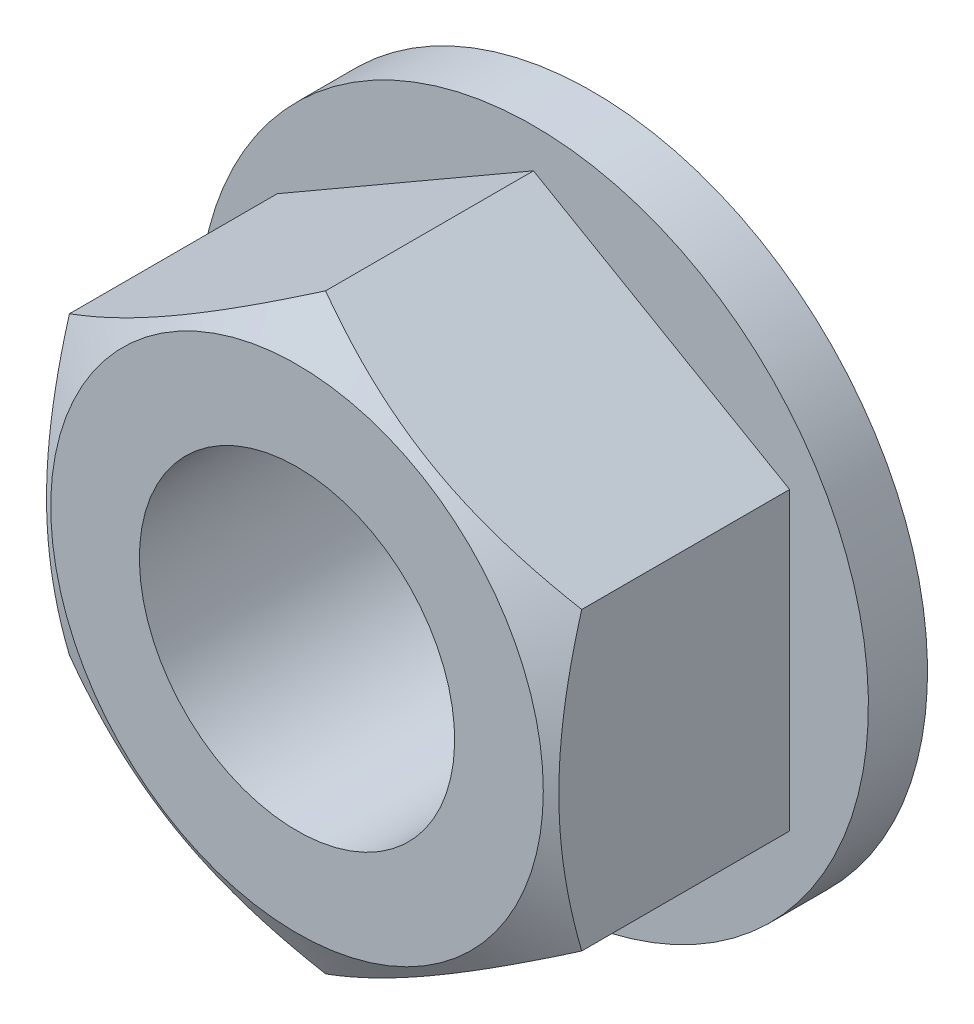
ISO-10303-21;
HEADER;
FILE_DESCRIPTION(('STEP AP214'),'2;1');
FILE_NAME('part.step','',(''),(''),'','','');
FILE_SCHEMA(('AUTOMOTIVE_DESIGN { 1 0 10303 214 1 1 1 1 }'));
ENDSEC;
DATA;
#1=APPLICATION_CONTEXT('core data for automotive mechanical design processes');
#2=APPLICATION_PROTOCOL_DEFINITION('international standard','automotive_design',2000,#1);
#3=PRODUCT_CONTEXT('',#1,'mechanical');
#4=PRODUCT('Part','Part','',(#3));
#5=PRODUCT_RELATED_PRODUCT_CATEGORY('part','',(#4));
#6=PRODUCT_DEFINITION_FORMATION('','',#4);
#7=PRODUCT_DEFINITION_CONTEXT('part definition',#1,'design');
#8=PRODUCT_DEFINITION('design','',#6,#7);
#9=PRODUCT_DEFINITION_SHAPE('','',#8);
#10=(LENGTH_UNIT() NAMED_UNIT(*) SI_UNIT(.MILLI.,.METRE.));
#11=(NAMED_UNIT(*) PLANE_ANGLE_UNIT() SI_UNIT($,.RADIAN.));
#12=(NAMED_UNIT(*) SI_UNIT($,.STERADIAN.) SOLID_ANGLE_UNIT());
#13=UNCERTAINTY_MEASURE_WITH_UNIT(LENGTH_MEASURE(1.E-05),#10,'distance_accuracy_value','');
#14=(GEOMETRIC_REPRESENTATION_CONTEXT(3) GLOBAL_UNCERTAINTY_ASSIGNED_CONTEXT((#13)) GLOBAL_UNIT_ASSIGNED_CONTEXT((#10,
#11,#12)) REPRESENTATION_CONTEXT('',''));
#15=CARTESIAN_POINT('',(0.,0.,0.));
#16=DIRECTION('',(0.,0.,1.));
#17=DIRECTION('',(1.,0.,0.));
#18=AXIS2_PLACEMENT_3D('',#15,#16,#17);
#19=CARTESIAN_POINT('',(6.,-3.46410161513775,7.5));
#20=DIRECTION('',(0.,0.,1.));
#21=DIRECTION('',(0.866025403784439,-0.5,0.));
#22=AXIS2_PLACEMENT_3D('',#19,#20,#21);
#23=PLANE('',#22);
#24=CARTESIAN_POINT('',(0.,0.,7.5));
#25=DIRECTION('',(0.,0.,1.));
#26=DIRECTION('',(0.866025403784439,-0.5,0.));
#27=AXIS2_PLACEMENT_3D('',#24,#25,#26);
#28=CIRCLE('',#27,4.);
#29=CARTESIAN_POINT('',(3.46410161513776,-2.,7.5));
#30=VERTEX_POINT('',#29);
#31=EDGE_CURVE('E28',#30,#30,#28,.T.);
#32=ORIENTED_EDGE('',*,*,#31,.F.);
#33=EDGE_LOOP('',(#32));
#34=FACE_BOUND('',#33,.T.);
#35=CARTESIAN_POINT('',(0.,0.,7.5));
#36=DIRECTION('',(0.,0.,1.));
#37=DIRECTION('',(1.,0.,0.));
#38=AXIS2_PLACEMENT_3D('',#35,#36,#37);
#39=CIRCLE('',#38,6.25);
#40=CARTESIAN_POINT('',(6.25,0.,7.5));
#41=VERTEX_POINT('',#40);
#42=EDGE_CURVE('E83',#41,#41,#39,.T.);
#43=ORIENTED_EDGE('',*,*,#42,.T.);
#44=EDGE_LOOP('',(#43));
#45=FACE_BOUND('',#44,.T.);
#46=ADVANCED_FACE('F14',(#34,#45),#23,.T.);
#47=CARTESIAN_POINT('',(0.,7.50555349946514,-18.3578280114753));
#48=DIRECTION('',(-0.5,0.866025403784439,0.));
#49=DIRECTION('',(-0.866025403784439,-0.5,0.));
#50=AXIS2_PLACEMENT_3D('',#47,#48,#49);
#51=PLANE('',#50);
#52=DIRECTION('',(0.,0.,1.));
#53=VECTOR('',#52,1.);
#54=CARTESIAN_POINT('',(-6.5,3.75277674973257,-18.3578280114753));
#55=LINE('',#54,#53);
#56=CARTESIAN_POINT('',(-6.5,3.75277674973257,1.5));
#57=VERTEX_POINT('',#56);
#58=CARTESIAN_POINT('',(-6.5,3.75277674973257,6.77510584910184));
#59=VERTEX_POINT('',#58);
#60=EDGE_CURVE('E41',#57,#59,#55,.T.);
#61=ORIENTED_EDGE('',*,*,#60,.T.);
#62=CARTESIAN_POINT('',(-6.5002,3.75266127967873,6.77503918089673));
#63=CARTESIAN_POINT('',(-6.35732254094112,3.83515161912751,6.82265800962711));
#64=CARTESIAN_POINT('',(-6.21391236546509,3.91794952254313,6.86811573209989));
#65=CARTESIAN_POINT('',(-5.9259273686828,4.08421773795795,6.95411375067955));
#66=CARTESIAN_POINT('',(-5.78135207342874,4.16768832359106,6.99465192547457));
#67=CARTESIAN_POINT('',(-5.34531134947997,4.41943655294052,7.10809143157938));
#68=CARTESIAN_POINT('',(-5.05212471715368,4.5887079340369,7.17261462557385));
#69=CARTESIAN_POINT('',(-4.61337625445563,4.84201947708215,7.2482758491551));
#70=CARTESIAN_POINT('',(-4.46912536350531,4.92530276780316,7.26982957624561));
#71=CARTESIAN_POINT('',(-4.17997178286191,5.09224566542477,7.30597211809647));
#72=CARTESIAN_POINT('',(-4.03506915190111,5.17590523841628,7.32056154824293));
#73=CARTESIAN_POINT('',(-3.74501222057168,5.34336968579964,7.34240368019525));
#74=CARTESIAN_POINT('',(-3.59985839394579,5.427174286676,7.34966470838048));
#75=CARTESIAN_POINT('',(-3.30942466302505,5.59485627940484,7.35670213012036));
#76=CARTESIAN_POINT('',(-3.16414476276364,5.6787336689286,7.35647875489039));
#77=CARTESIAN_POINT('',(-2.76612405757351,5.90853103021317,7.34557897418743));
#78=CARTESIAN_POINT('',(-2.51351353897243,6.05437578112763,7.32728061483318));
#79=CARTESIAN_POINT('',(-2.00997032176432,6.34509659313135,7.26925609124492));
#80=CARTESIAN_POINT('',(-1.75903939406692,6.48997163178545,7.22951009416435));
#81=CARTESIAN_POINT('',(-1.25448277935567,6.78127752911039,7.13015652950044));
#82=CARTESIAN_POINT('',(-1.00092075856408,6.92767163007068,7.07012800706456));
#83=CARTESIAN_POINT('',(-0.497578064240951,7.21827667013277,6.93388744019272));
#84=CARTESIAN_POINT('',(-0.247790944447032,7.36249133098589,6.857707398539));
#85=CARTESIAN_POINT('',(0.000200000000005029,7.50566896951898,6.77503918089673));
#86=B_SPLINE_CURVE_WITH_KNOTS('',3,(#62,#63,#64,#65,#66,#67,#68,#69,#70,#71,#72,#73,#74,#75,#76,
#77,#78,#79,#80,#81,#82,#83,#84,#85),.UNSPECIFIED.,.F.,.F.,(4,2,2,2,2,2,2,2,2,2,2,4),(0.,
0.515105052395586,1.03043143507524,2.06322554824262,2.56697389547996,3.07067772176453,
3.57380860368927,4.07692394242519,4.9527935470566,5.82947446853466,6.72559912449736,
7.61996451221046),.UNSPECIFIED.);
#87=CARTESIAN_POINT('',(0.,7.50555349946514,6.77510584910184));
#88=VERTEX_POINT('',#87);
#89=EDGE_CURVE('E35',#59,#88,#86,.T.);
#90=ORIENTED_EDGE('',*,*,#89,.T.);
#91=DIRECTION('',(0.,0.,1.));
#92=VECTOR('',#91,1.);
#93=CARTESIAN_POINT('',(0.,7.50555349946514,-18.3578280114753));
#94=LINE('',#93,#92);
#95=CARTESIAN_POINT('',(0.,7.50555349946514,1.5));
#96=VERTEX_POINT('',#95);
#97=EDGE_CURVE('E224',#96,#88,#94,.T.);
#98=ORIENTED_EDGE('',*,*,#97,.F.);
#99=DIRECTION('',(-0.866025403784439,-0.5,0.));
#100=VECTOR('',#99,1.);
#101=CARTESIAN_POINT('',(0.,7.50555349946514,1.5));
#102=LINE('',#101,#100);
#103=EDGE_CURVE('E100',#96,#57,#102,.T.);
#104=ORIENTED_EDGE('',*,*,#103,.T.);
#105=EDGE_LOOP('',(#61,#90,#98,#104));
#106=FACE_BOUND('',#105,.T.);
#107=ADVANCED_FACE('F119',(#106),#51,.T.);
#108=CARTESIAN_POINT('',(6.5,3.75277674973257,-18.3578280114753));
#109=DIRECTION('',(0.5,0.866025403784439,0.));
#110=DIRECTION('',(0.,0.,1.));
#111=AXIS2_PLACEMENT_3D('',#108,#109,#110);
#112=PLANE('',#111);
#113=ORIENTED_EDGE('',*,*,#97,.T.);
#114=CARTESIAN_POINT('',(-0.000199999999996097,7.50566896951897,6.77503918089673));
#115=CARTESIAN_POINT('',(0.142677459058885,7.4231786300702,6.82265800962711));
#116=CARTESIAN_POINT('',(0.286087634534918,7.34038072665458,6.86811573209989));
#117=CARTESIAN_POINT('',(0.574072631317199,7.17411251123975,6.95411375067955));
#118=CARTESIAN_POINT('',(0.718647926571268,7.09064192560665,6.99465192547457));
#119=CARTESIAN_POINT('',(1.15468865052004,6.83889369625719,7.10809143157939));
#120=CARTESIAN_POINT('',(1.44787528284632,6.66962231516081,7.17261462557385));
#121=CARTESIAN_POINT('',(1.88662374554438,6.41631077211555,7.2482758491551));
#122=CARTESIAN_POINT('',(2.03087463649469,6.33302748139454,7.26982957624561));
#123=CARTESIAN_POINT('',(2.32002821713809,6.16608458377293,7.30597211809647));
#124=CARTESIAN_POINT('',(2.46493084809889,6.08242501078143,7.32056154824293));
#125=CARTESIAN_POINT('',(2.75498777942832,5.91496056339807,7.34240368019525));
#126=CARTESIAN_POINT('',(2.90014160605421,5.8311559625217,7.34966470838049));
#127=CARTESIAN_POINT('',(3.19057533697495,5.66347396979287,7.35670213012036));
#128=CARTESIAN_POINT('',(3.33585523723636,5.5795965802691,7.35647875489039));
#129=CARTESIAN_POINT('',(3.73387594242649,5.34979921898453,7.34557897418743));
#130=CARTESIAN_POINT('',(3.98648646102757,5.20395446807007,7.32728061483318));
#131=CARTESIAN_POINT('',(4.49002967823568,4.91323365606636,7.26925609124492));
#132=CARTESIAN_POINT('',(4.74096060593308,4.76835861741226,7.22951009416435));
#133=CARTESIAN_POINT('',(5.24551722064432,4.47705272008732,7.13015652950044));
#134=CARTESIAN_POINT('',(5.49907924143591,4.33065861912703,7.07012800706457));
#135=CARTESIAN_POINT('',(6.00242193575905,4.04005357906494,6.93388744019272));
#136=CARTESIAN_POINT('',(6.25220905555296,3.89583891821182,6.857707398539));
#137=CARTESIAN_POINT('',(6.5002,3.75266127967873,6.77503918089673));
#138=B_SPLINE_CURVE_WITH_KNOTS('',3,(#114,#115,#116,#117,#118,#119,#120,#121,#122,#123,#124,
#125,#126,#127,#128,#129,#130,#131,#132,#133,#134,#135,#136,#137),.UNSPECIFIED.,.F.,.F.,(4,2,2,
2,2,2,2,2,2,2,2,4),(0.,0.515105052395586,1.03043143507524,2.06322554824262,2.56697389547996,
3.07067772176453,3.57380860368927,4.07692394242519,4.95279354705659,5.82947446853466,
6.72559912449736,7.61996451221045),.UNSPECIFIED.);
#139=CARTESIAN_POINT('',(6.5,3.75277674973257,6.77510584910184));
#140=VERTEX_POINT('',#139);
#141=EDGE_CURVE('E153',#88,#140,#138,.T.);
#142=ORIENTED_EDGE('',*,*,#141,.T.);
#143=DIRECTION('',(0.,0.,1.));
#144=VECTOR('',#143,1.);
#145=CARTESIAN_POINT('',(6.5,3.75277674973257,-18.3578280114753));
#146=LINE('',#145,#144);
#147=CARTESIAN_POINT('',(6.5,3.75277674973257,1.5));
#148=VERTEX_POINT('',#147);
#149=EDGE_CURVE('E218',#148,#140,#146,.T.);
#150=ORIENTED_EDGE('',*,*,#149,.F.);
#151=DIRECTION('',(-0.866025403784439,0.5,0.));
#152=VECTOR('',#151,1.);
#153=CARTESIAN_POINT('',(6.5,3.75277674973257,1.5));
#154=LINE('',#153,#152);
#155=EDGE_CURVE('E99',#148,#96,#154,.T.);
#156=ORIENTED_EDGE('',*,*,#155,.T.);
#157=EDGE_LOOP('',(#113,#142,#150,#156));
#158=FACE_BOUND('',#157,.T.);
#159=ADVANCED_FACE('F165',(#158),#112,.T.);
#160=CARTESIAN_POINT('',(6.5,-3.75277674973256,-18.3578280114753));
#161=DIRECTION('',(1.,0.,0.));
#162=DIRECTION('',(0.,1.,0.));
#163=AXIS2_PLACEMENT_3D('',#160,#161,#162);
#164=PLANE('',#163);
#165=ORIENTED_EDGE('',*,*,#149,.T.);
#166=CARTESIAN_POINT('',(6.5,-10.0728796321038,4.1871458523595));
#167=CARTESIAN_POINT('',(6.5,-9.78904380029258,4.32480135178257));
#168=CARTESIAN_POINT('',(6.5,-9.50455558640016,4.46113476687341));
#169=CARTESIAN_POINT('',(6.5,-8.93392743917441,4.73041370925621));
#170=CARTESIAN_POINT('',(6.5,-8.6477872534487,4.86335870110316));
#171=CARTESIAN_POINT('',(6.5,-8.07203033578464,5.1257875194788));
#172=CARTESIAN_POINT('',(6.5,-7.78240315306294,5.25524849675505));
#173=CARTESIAN_POINT('',(6.5,-7.2008425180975,5.50886235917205));
#174=CARTESIAN_POINT('',(6.5,-6.90890917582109,5.63301549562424));
#175=CARTESIAN_POINT('',(6.5,-6.31288048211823,5.87847985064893));
#176=CARTESIAN_POINT('',(6.5,-6.00869485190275,5.99957305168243));
#177=CARTESIAN_POINT('',(6.5,-5.39676174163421,6.23257630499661));
#178=CARTESIAN_POINT('',(6.5,-5.08901386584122,6.34448532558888));
#179=CARTESIAN_POINT('',(6.5,-4.47004629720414,6.55617723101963));
#180=CARTESIAN_POINT('',(6.5,-4.15883510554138,6.6559847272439));
#181=CARTESIAN_POINT('',(6.5,-3.53194527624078,6.8402647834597));
#182=CARTESIAN_POINT('',(6.5,-3.21626808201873,6.9247421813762));
#183=CARTESIAN_POINT('',(6.5,-2.58203231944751,7.07385809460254));
#184=CARTESIAN_POINT('',(6.5,-2.26349936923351,7.13860382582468));
#185=CARTESIAN_POINT('',(6.5,-1.62243510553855,7.24457625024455));
#186=CARTESIAN_POINT('',(6.5,-1.29990417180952,7.28580515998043));
#187=CARTESIAN_POINT('',(6.5,-0.816536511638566,7.32727322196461));
#188=CARTESIAN_POINT('',(6.5,-0.656533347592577,7.33769678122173));
#189=CARTESIAN_POINT('',(6.5,-0.336222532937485,7.35177467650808));
#190=CARTESIAN_POINT('',(6.5,-0.175914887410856,7.3554291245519));
#191=CARTESIAN_POINT('',(6.5,0.144709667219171,7.35587411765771));
#192=CARTESIAN_POINT('',(6.5,0.305026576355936,7.35266463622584));
#193=CARTESIAN_POINT('',(6.5,0.625383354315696,7.33946206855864));
#194=CARTESIAN_POINT('',(6.5,0.785423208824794,7.32946864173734));
#195=CARTESIAN_POINT('',(6.5,1.17027275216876,7.2974909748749));
#196=CARTESIAN_POINT('',(6.5,1.39481951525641,7.27227523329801));
#197=CARTESIAN_POINT('',(6.5,1.84223103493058,7.20986555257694));
#198=CARTESIAN_POINT('',(6.5,2.06509555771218,7.17266997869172));
#199=CARTESIAN_POINT('',(6.5,2.7309193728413,7.04508704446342));
#200=CARTESIAN_POINT('',(6.5,3.17085766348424,6.93872709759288));
#201=CARTESIAN_POINT('',(6.5,3.82867749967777,6.75447989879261));
#202=CARTESIAN_POINT('',(6.5,4.04997582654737,6.68809168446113));
#203=CARTESIAN_POINT('',(6.5,4.49042271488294,6.54846732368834));
#204=CARTESIAN_POINT('',(6.5,4.70957126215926,6.47523113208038));
#205=CARTESIAN_POINT('',(6.5,5.1457884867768,6.32308195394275));
#206=CARTESIAN_POINT('',(6.5,5.36285783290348,6.24417086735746));
#207=CARTESIAN_POINT('',(6.5,5.79520115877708,6.08159565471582));
#208=CARTESIAN_POINT('',(6.5,6.01047515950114,5.99793158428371));
#209=CARTESIAN_POINT('',(6.5,6.51834251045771,5.79512807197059));
#210=CARTESIAN_POINT('',(6.5,6.81024471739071,5.6742610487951));
#211=CARTESIAN_POINT('',(6.5,7.3915705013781,5.42668947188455));
#212=CARTESIAN_POINT('',(6.5,7.68099392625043,5.29998456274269));
#213=CARTESIAN_POINT('',(6.5,8.25781819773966,5.04190984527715));
#214=CARTESIAN_POINT('',(6.5,8.54521862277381,4.91053909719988));
#215=CARTESIAN_POINT('',(6.5,9.11828767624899,4.64406650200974));
#216=CARTESIAN_POINT('',(6.5,9.40395626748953,4.50896457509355));
#217=CARTESIAN_POINT('',(6.5,9.97414428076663,4.23558683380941));
#218=CARTESIAN_POINT('',(6.5,10.258662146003,4.09730777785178));
#219=CARTESIAN_POINT('',(6.5,10.8264728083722,3.81825460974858));
#220=CARTESIAN_POINT('',(6.5,11.1097655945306,3.67748047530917));
#221=CARTESIAN_POINT('',(6.5,11.9580236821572,3.25211680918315));
#222=CARTESIAN_POINT('',(6.5,12.5214451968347,2.96444904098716));
#223=CARTESIAN_POINT('',(6.5,13.5981452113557,2.40772193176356));
#224=CARTESIAN_POINT('',(6.5,14.1116645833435,2.13912635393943));
#225=CARTESIAN_POINT('',(6.5,15.1367973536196,1.59828118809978));
#226=CARTESIAN_POINT('',(6.5,15.6484106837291,1.32603147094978));
#227=CARTESIAN_POINT('',(6.5,16.6688771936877,0.779431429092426));
#228=CARTESIAN_POINT('',(6.5,17.1777340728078,0.505087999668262));
#229=CARTESIAN_POINT('',(6.5,18.1942292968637,-0.0457814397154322));
#230=CARTESIAN_POINT('',(6.5,18.7018677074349,-0.322307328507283));
#231=CARTESIAN_POINT('',(6.5,19.2090577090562,-0.599647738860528));
#232=B_SPLINE_CURVE_WITH_KNOTS('',3,(#166,#167,#168,#169,#170,#171,#172,#173,#174,#175,#176,
#177,#178,#179,#180,#181,#182,#183,#184,#185,#186,#187,#188,#189,#190,#191,#192,#193,#194,#195,
#196,#197,#198,#199,#200,#201,#202,#203,#204,#205,#206,#207,#208,#209,#210,#211,#212,#213,#214,
#215,#216,#217,#218,#219,#220,#221,#222,#223,#224,#225,#226,#227,#228,#229,#230,#231),
.UNSPECIFIED.,.F.,.F.,(4,2,2,2,2,2,2,2,2,2,2,2,2,2,2,2,2,2,2,2,2,2,2,2,2,2,2,2,2,2,2,2,4),(0.,
0.946376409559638,1.89290145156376,2.84459220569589,3.79623784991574,4.7783311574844,
5.76053463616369,6.74070581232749,7.7205671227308,8.69500512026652,9.66935125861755,
10.1502568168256,10.6311544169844,11.1120538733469,11.5929774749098,12.2704690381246,
12.9480530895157,14.3039748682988,14.9970431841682,15.6901160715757,16.3829579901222,
17.0757918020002,18.0235149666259,18.9712959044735,19.9192688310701,20.8672620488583,
21.81626968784,22.7652858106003,24.6630632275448,26.401613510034,28.1402253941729,
29.8745198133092,31.6087186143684),.UNSPECIFIED.);
#233=CARTESIAN_POINT('',(6.5,-3.75277674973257,6.77510584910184));
#234=VERTEX_POINT('',#233);
#235=EDGE_CURVE('E146',#140,#234,#232,.F.);
#236=ORIENTED_EDGE('',*,*,#235,.T.);
#237=DIRECTION('',(0.,0.,1.));
#238=VECTOR('',#237,1.);
#239=CARTESIAN_POINT('',(6.5,-3.75277674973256,-18.3578280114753));
#240=LINE('',#239,#238);
#241=CARTESIAN_POINT('',(6.5,-3.75277674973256,1.5));
#242=VERTEX_POINT('',#241);
#243=EDGE_CURVE('E210',#242,#234,#240,.T.);
#244=ORIENTED_EDGE('',*,*,#243,.F.);
#245=DIRECTION('',(0.,1.,0.));
#246=VECTOR('',#245,1.);
#247=CARTESIAN_POINT('',(6.5,-3.75277674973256,1.5));
#248=LINE('',#247,#246);
#249=EDGE_CURVE('E223',#242,#148,#248,.T.);
#250=ORIENTED_EDGE('',*,*,#249,.T.);
#251=EDGE_LOOP('',(#165,#236,#244,#250));
#252=FACE_BOUND('',#251,.T.);
#253=ADVANCED_FACE('F168',(#252),#164,.T.);
#254=CARTESIAN_POINT('',(0.,-7.50555349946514,-18.3578280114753));
#255=DIRECTION('',(0.5,-0.866025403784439,0.));
#256=DIRECTION('',(0.866025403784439,0.5,0.));
#257=AXIS2_PLACEMENT_3D('',#254,#255,#256);
#258=PLANE('',#257);
#259=ORIENTED_EDGE('',*,*,#243,.T.);
#260=CARTESIAN_POINT('',(6.5002,-3.75266127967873,6.77503918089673));
#261=CARTESIAN_POINT('',(6.35732254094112,-3.83515161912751,6.82265800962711));
#262=CARTESIAN_POINT('',(6.21391236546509,-3.91794952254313,6.86811573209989));
#263=CARTESIAN_POINT('',(5.9259273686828,-4.08421773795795,6.95411375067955));
#264=CARTESIAN_POINT('',(5.78135207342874,-4.16768832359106,6.99465192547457));
#265=CARTESIAN_POINT('',(5.34531134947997,-4.41943655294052,7.10809143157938));
#266=CARTESIAN_POINT('',(5.05212471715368,-4.5887079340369,7.17261462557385));
#267=CARTESIAN_POINT('',(4.61337625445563,-4.84201947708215,7.2482758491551));
#268=CARTESIAN_POINT('',(4.46912536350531,-4.92530276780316,7.26982957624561));
#269=CARTESIAN_POINT('',(4.17997178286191,-5.09224566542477,7.30597211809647));
#270=CARTESIAN_POINT('',(4.03506915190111,-5.17590523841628,7.32056154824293));
#271=CARTESIAN_POINT('',(3.74501222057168,-5.34336968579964,7.34240368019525));
#272=CARTESIAN_POINT('',(3.59985839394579,-5.427174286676,7.34966470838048));
#273=CARTESIAN_POINT('',(3.30942466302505,-5.59485627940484,7.35670213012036));
#274=CARTESIAN_POINT('',(3.16414476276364,-5.6787336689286,7.35647875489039));
#275=CARTESIAN_POINT('',(2.76612405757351,-5.90853103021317,7.34557897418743));
#276=CARTESIAN_POINT('',(2.51351353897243,-6.05437578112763,7.32728061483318));
#277=CARTESIAN_POINT('',(2.00997032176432,-6.34509659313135,7.26925609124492));
#278=CARTESIAN_POINT('',(1.75903939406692,-6.48997163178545,7.22951009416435));
#279=CARTESIAN_POINT('',(1.25448277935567,-6.78127752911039,7.13015652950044));
#280=CARTESIAN_POINT('',(1.00092075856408,-6.92767163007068,7.07012800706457));
#281=CARTESIAN_POINT('',(0.497578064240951,-7.21827667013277,6.93388744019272));
#282=CARTESIAN_POINT('',(0.247790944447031,-7.36249133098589,6.857707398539));
#283=CARTESIAN_POINT('',(-0.000200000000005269,-7.50566896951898,6.77503918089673));
#284=B_SPLINE_CURVE_WITH_KNOTS('',3,(#260,#261,#262,#263,#264,#265,#266,#267,#268,#269,#270,
#271,#272,#273,#274,#275,#276,#277,#278,#279,#280,#281,#282,#283),.UNSPECIFIED.,.F.,.F.,(4,2,2,
2,2,2,2,2,2,2,2,4),(0.,0.515105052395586,1.03043143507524,2.06322554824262,2.56697389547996,
3.07067772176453,3.57380860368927,4.07692394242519,4.9527935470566,5.82947446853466,
6.72559912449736,7.61996451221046),.UNSPECIFIED.);
#285=CARTESIAN_POINT('',(0.,-7.50555349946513,6.77510584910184));
#286=VERTEX_POINT('',#285);
#287=EDGE_CURVE('E82',#234,#286,#284,.T.);
#288=ORIENTED_EDGE('',*,*,#287,.T.);
#289=DIRECTION('',(0.,0.,1.));
#290=VECTOR('',#289,1.);
#291=CARTESIAN_POINT('',(0.,-7.50555349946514,-18.3578280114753));
#292=LINE('',#291,#290);
#293=CARTESIAN_POINT('',(0.,-7.50555349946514,1.5));
#294=VERTEX_POINT('',#293);
#295=EDGE_CURVE('E81',#294,#286,#292,.T.);
#296=ORIENTED_EDGE('',*,*,#295,.F.);
#297=DIRECTION('',(0.866025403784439,0.5,0.));
#298=VECTOR('',#297,1.);
#299=CARTESIAN_POINT('',(0.,-7.50555349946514,1.5));
#300=LINE('',#299,#298);
#301=EDGE_CURVE('E212',#294,#242,#300,.T.);
#302=ORIENTED_EDGE('',*,*,#301,.T.);
#303=EDGE_LOOP('',(#259,#288,#296,#302));
#304=FACE_BOUND('',#303,.T.);
#305=ADVANCED_FACE('F196',(#304),#258,.T.);
#306=CARTESIAN_POINT('',(-6.5,-3.75277674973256,-18.3578280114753));
#307=DIRECTION('',(-0.5,-0.866025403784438,0.));
#308=DIRECTION('',(0.866025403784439,-0.5,0.));
#309=AXIS2_PLACEMENT_3D('',#306,#307,#308);
#310=PLANE('',#309);
#311=ORIENTED_EDGE('',*,*,#295,.T.);
#312=CARTESIAN_POINT('',(0.000199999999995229,-7.50566896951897,6.77503918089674));
#313=CARTESIAN_POINT('',(-0.142677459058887,-7.42317863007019,6.82265800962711));
#314=CARTESIAN_POINT('',(-0.286087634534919,-7.34038072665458,6.86811573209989));
#315=CARTESIAN_POINT('',(-0.574072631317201,-7.17411251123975,6.95411375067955));
#316=CARTESIAN_POINT('',(-0.71864792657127,-7.09064192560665,6.99465192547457));
#317=CARTESIAN_POINT('',(-1.15468865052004,-6.83889369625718,7.10809143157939));
#318=CARTESIAN_POINT('',(-1.44787528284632,-6.6696223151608,7.17261462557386));
#319=CARTESIAN_POINT('',(-1.88662374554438,-6.41631077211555,7.2482758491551));
#320=CARTESIAN_POINT('',(-2.03087463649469,-6.33302748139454,7.26982957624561));
#321=CARTESIAN_POINT('',(-2.32002821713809,-6.16608458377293,7.30597211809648));
#322=CARTESIAN_POINT('',(-2.46493084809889,-6.08242501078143,7.32056154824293));
#323=CARTESIAN_POINT('',(-2.75498777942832,-5.91496056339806,7.34240368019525));
#324=CARTESIAN_POINT('',(-2.90014160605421,-5.8311559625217,7.34966470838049));
#325=CARTESIAN_POINT('',(-3.19057533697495,-5.66347396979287,7.35670213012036));
#326=CARTESIAN_POINT('',(-3.33585523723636,-5.5795965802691,7.35647875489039));
#327=CARTESIAN_POINT('',(-3.73387594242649,-5.34979921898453,7.34557897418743));
#328=CARTESIAN_POINT('',(-3.98648646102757,-5.20395446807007,7.32728061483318));
#329=CARTESIAN_POINT('',(-4.49002967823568,-4.91323365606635,7.26925609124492));
#330=CARTESIAN_POINT('',(-4.74096060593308,-4.76835861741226,7.22951009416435));
#331=CARTESIAN_POINT('',(-5.24551722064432,-4.47705272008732,7.13015652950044));
#332=CARTESIAN_POINT('',(-5.49907924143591,-4.33065861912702,7.07012800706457));
#333=CARTESIAN_POINT('',(-6.00242193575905,-4.04005357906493,6.93388744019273));
#334=CARTESIAN_POINT('',(-6.25220905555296,-3.89583891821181,6.857707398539));
#335=CARTESIAN_POINT('',(-6.5002,-3.75266127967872,6.77503918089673));
#336=B_SPLINE_CURVE_WITH_KNOTS('',3,(#312,#313,#314,#315,#316,#317,#318,#319,#320,#321,#322,
#323,#324,#325,#326,#327,#328,#329,#330,#331,#332,#333,#334,#335),.UNSPECIFIED.,.F.,.F.,(4,2,2,
2,2,2,2,2,2,2,2,4),(0.,0.515105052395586,1.03043143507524,2.06322554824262,2.56697389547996,
3.07067772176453,3.57380860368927,4.07692394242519,4.95279354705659,5.82947446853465,
6.72559912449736,7.61996451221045),.UNSPECIFIED.);
#337=CARTESIAN_POINT('',(-6.5,-3.75277674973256,6.77510584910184));
#338=VERTEX_POINT('',#337);
#339=EDGE_CURVE('E73',#286,#338,#336,.T.);
#340=ORIENTED_EDGE('',*,*,#339,.T.);
#341=DIRECTION('',(0.,0.,1.));
#342=VECTOR('',#341,1.);
#343=CARTESIAN_POINT('',(-6.5,-3.75277674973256,-18.3578280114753));
#344=LINE('',#343,#342);
#345=CARTESIAN_POINT('',(-6.5,-3.75277674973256,1.5));
#346=VERTEX_POINT('',#345);
#347=EDGE_CURVE('E80',#346,#338,#344,.T.);
#348=ORIENTED_EDGE('',*,*,#347,.F.);
#349=DIRECTION('',(0.866025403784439,-0.5,0.));
#350=VECTOR('',#349,1.);
#351=CARTESIAN_POINT('',(-6.5,-3.75277674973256,1.5));
#352=LINE('',#351,#350);
#353=EDGE_CURVE('E216',#346,#294,#352,.T.);
#354=ORIENTED_EDGE('',*,*,#353,.T.);
#355=EDGE_LOOP('',(#311,#340,#348,#354));
#356=FACE_BOUND('',#355,.T.);
#357=ADVANCED_FACE('F78',(#356),#310,.T.);
#358=CARTESIAN_POINT('',(-6.5,3.75277674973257,-18.3578280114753));
#359=DIRECTION('',(-1.,0.,0.));
#360=DIRECTION('',(0.,-1.,0.));
#361=AXIS2_PLACEMENT_3D('',#358,#359,#360);
#362=PLANE('',#361);
#363=ORIENTED_EDGE('',*,*,#347,.T.);
#364=CARTESIAN_POINT('',(-6.5,-10.0728796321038,4.1871458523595));
#365=CARTESIAN_POINT('',(-6.5,-9.78904380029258,4.32480135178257));
#366=CARTESIAN_POINT('',(-6.5,-9.50455558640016,4.46113476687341));
#367=CARTESIAN_POINT('',(-6.5,-8.93392743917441,4.73041370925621));
#368=CARTESIAN_POINT('',(-6.5,-8.6477872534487,4.86335870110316));
#369=CARTESIAN_POINT('',(-6.5,-8.07203033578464,5.1257875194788));
#370=CARTESIAN_POINT('',(-6.5,-7.78240315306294,5.25524849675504));
#371=CARTESIAN_POINT('',(-6.5,-7.2008425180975,5.50886235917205));
#372=CARTESIAN_POINT('',(-6.5,-6.90890917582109,5.63301549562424));
#373=CARTESIAN_POINT('',(-6.5,-6.31288048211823,5.87847985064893));
#374=CARTESIAN_POINT('',(-6.5,-6.00869485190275,5.99957305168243));
#375=CARTESIAN_POINT('',(-6.5,-5.39676174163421,6.23257630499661));
#376=CARTESIAN_POINT('',(-6.5,-5.08901386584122,6.34448532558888));
#377=CARTESIAN_POINT('',(-6.5,-4.47004629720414,6.55617723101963));
#378=CARTESIAN_POINT('',(-6.5,-4.15883510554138,6.6559847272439));
#379=CARTESIAN_POINT('',(-6.5,-3.53194527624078,6.84026478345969));
#380=CARTESIAN_POINT('',(-6.5,-3.21626808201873,6.9247421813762));
#381=CARTESIAN_POINT('',(-6.5,-2.58203231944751,7.07385809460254));
#382=CARTESIAN_POINT('',(-6.5,-2.26349936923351,7.13860382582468));
#383=CARTESIAN_POINT('',(-6.5,-1.62243510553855,7.24457625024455));
#384=CARTESIAN_POINT('',(-6.5,-1.29990417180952,7.28580515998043));
#385=CARTESIAN_POINT('',(-6.5,-0.816536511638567,7.32727322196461));
#386=CARTESIAN_POINT('',(-6.5,-0.656533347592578,7.33769678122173));
#387=CARTESIAN_POINT('',(-6.5,-0.336222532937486,7.35177467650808));
#388=CARTESIAN_POINT('',(-6.5,-0.175914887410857,7.3554291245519));
#389=CARTESIAN_POINT('',(-6.5,0.14470966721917,7.35587411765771));
#390=CARTESIAN_POINT('',(-6.5,0.305026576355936,7.35266463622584));
#391=CARTESIAN_POINT('',(-6.5,0.625383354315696,7.33946206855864));
#392=CARTESIAN_POINT('',(-6.5,0.785423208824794,7.32946864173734));
#393=CARTESIAN_POINT('',(-6.5,1.17027275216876,7.2974909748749));
#394=CARTESIAN_POINT('',(-6.5,1.39481951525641,7.27227523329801));
#395=CARTESIAN_POINT('',(-6.5,1.84223103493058,7.20986555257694));
#396=CARTESIAN_POINT('',(-6.5,2.06509555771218,7.17266997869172));
#397=CARTESIAN_POINT('',(-6.5,2.73091937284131,7.04508704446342));
#398=CARTESIAN_POINT('',(-6.5,3.17085766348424,6.93872709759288));
#399=CARTESIAN_POINT('',(-6.5,3.82867749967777,6.75447989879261));
#400=CARTESIAN_POINT('',(-6.5,4.04997582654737,6.68809168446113));
#401=CARTESIAN_POINT('',(-6.5,4.49042271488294,6.54846732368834));
#402=CARTESIAN_POINT('',(-6.5,4.70957126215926,6.47523113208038));
#403=CARTESIAN_POINT('',(-6.5,5.14578848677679,6.32308195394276));
#404=CARTESIAN_POINT('',(-6.5,5.36285783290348,6.24417086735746));
#405=CARTESIAN_POINT('',(-6.5,5.79520115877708,6.08159565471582));
#406=CARTESIAN_POINT('',(-6.5,6.01047515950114,5.99793158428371));
#407=CARTESIAN_POINT('',(-6.5,6.51834251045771,5.79512807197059));
#408=CARTESIAN_POINT('',(-6.5,6.81024471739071,5.6742610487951));
#409=CARTESIAN_POINT('',(-6.5,7.3915705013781,5.42668947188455));
#410=CARTESIAN_POINT('',(-6.5,7.68099392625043,5.29998456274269));
#411=CARTESIAN_POINT('',(-6.5,8.25781819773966,5.04190984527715));
#412=CARTESIAN_POINT('',(-6.5,8.54521862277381,4.91053909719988));
#413=CARTESIAN_POINT('',(-6.5,9.11828767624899,4.64406650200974));
#414=CARTESIAN_POINT('',(-6.5,9.40395626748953,4.50896457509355));
#415=CARTESIAN_POINT('',(-6.5,9.97414428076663,4.23558683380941));
#416=CARTESIAN_POINT('',(-6.5,10.258662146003,4.09730777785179));
#417=CARTESIAN_POINT('',(-6.5,10.8264728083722,3.81825460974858));
#418=CARTESIAN_POINT('',(-6.5,11.1097655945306,3.67748047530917));
#419=CARTESIAN_POINT('',(-6.5,11.9580236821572,3.25211680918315));
#420=CARTESIAN_POINT('',(-6.5,12.5214451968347,2.96444904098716));
#421=CARTESIAN_POINT('',(-6.5,13.5981452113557,2.40772193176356));
#422=CARTESIAN_POINT('',(-6.5,14.1116645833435,2.13912635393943));
#423=CARTESIAN_POINT('',(-6.5,15.1367973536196,1.59828118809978));
#424=CARTESIAN_POINT('',(-6.5,15.6484106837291,1.32603147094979));
#425=CARTESIAN_POINT('',(-6.5,16.6688771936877,0.779431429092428));
#426=CARTESIAN_POINT('',(-6.5,17.1777340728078,0.505087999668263));
#427=CARTESIAN_POINT('',(-6.5,18.1942292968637,-0.0457814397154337));
#428=CARTESIAN_POINT('',(-6.5,18.7018677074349,-0.322307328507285));
#429=CARTESIAN_POINT('',(-6.5,19.2090577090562,-0.599647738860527));
#430=B_SPLINE_CURVE_WITH_KNOTS('',3,(#364,#365,#366,#367,#368,#369,#370,#371,#372,#373,#374,
#375,#376,#377,#378,#379,#380,#381,#382,#383,#384,#385,#386,#387,#388,#389,#390,#391,#392,#393,
#394,#395,#396,#397,#398,#399,#400,#401,#402,#403,#404,#405,#406,#407,#408,#409,#410,#411,#412,
#413,#414,#415,#416,#417,#418,#419,#420,#421,#422,#423,#424,#425,#426,#427,#428,#429),
.UNSPECIFIED.,.F.,.F.,(4,2,2,2,2,2,2,2,2,2,2,2,2,2,2,2,2,2,2,2,2,2,2,2,2,2,2,2,2,2,2,2,4),(0.,
0.94637640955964,1.89290145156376,2.84459220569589,3.79623784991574,4.77833115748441,
5.76053463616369,6.74070581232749,7.7205671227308,8.69500512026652,9.66935125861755,
10.1502568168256,10.6311544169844,11.1120538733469,11.5929774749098,12.2704690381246,
12.9480530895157,14.3039748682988,14.9970431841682,15.6901160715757,16.3829579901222,
17.0757918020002,18.0235149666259,18.9712959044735,19.9192688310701,20.8672620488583,
21.81626968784,22.7652858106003,24.6630632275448,26.401613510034,28.140225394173,
29.8745198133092,31.6087186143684),.UNSPECIFIED.);
#431=EDGE_CURVE('E9',#338,#59,#430,.T.);
#432=ORIENTED_EDGE('',*,*,#431,.T.);
#433=ORIENTED_EDGE('',*,*,#60,.F.);
#434=DIRECTION('',(0.,-1.,0.));
#435=VECTOR('',#434,1.);
#436=CARTESIAN_POINT('',(-6.5,3.75277674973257,1.5));
#437=LINE('',#436,#435);
#438=EDGE_CURVE('E87',#57,#346,#437,.T.);
#439=ORIENTED_EDGE('',*,*,#438,.T.);
#440=EDGE_LOOP('',(#363,#432,#433,#439));
#441=FACE_BOUND('',#440,.T.);
#442=ADVANCED_FACE('F85',(#441),#362,.T.);
#443=CARTESIAN_POINT('',(6.,-3.46410161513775,0.));
#444=DIRECTION('',(0.,0.,1.));
#445=DIRECTION('',(0.866025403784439,-0.5,0.));
#446=AXIS2_PLACEMENT_3D('',#443,#444,#445);
#447=PLANE('',#446);
#448=CARTESIAN_POINT('',(0.,0.,0.));
#449=DIRECTION('',(0.,0.,1.));
#450=DIRECTION('',(0.866025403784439,-0.5,0.));
#451=AXIS2_PLACEMENT_3D('',#448,#449,#450);
#452=CIRCLE('',#451,4.);
#453=CARTESIAN_POINT('',(3.46410161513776,-2.,0.));
#454=VERTEX_POINT('',#453);
#455=EDGE_CURVE('E102',#454,#454,#452,.T.);
#456=ORIENTED_EDGE('',*,*,#455,.T.);
#457=EDGE_LOOP('',(#456));
#458=FACE_BOUND('',#457,.T.);
#459=CARTESIAN_POINT('',(0.,0.,0.));
#460=DIRECTION('',(0.,0.,-1.));
#461=DIRECTION('',(-0.866025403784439,0.5,0.));
#462=AXIS2_PLACEMENT_3D('',#459,#460,#461);
#463=CIRCLE('',#462,8.5);
#464=CARTESIAN_POINT('',(-7.36121593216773,4.25,0.));
#465=VERTEX_POINT('',#464);
#466=EDGE_CURVE('E89',#465,#465,#463,.T.);
#467=ORIENTED_EDGE('',*,*,#466,.T.);
#468=EDGE_LOOP('',(#467));
#469=FACE_BOUND('',#468,.T.);
#470=ADVANCED_FACE('F16',(#458,#469),#447,.F.);
#471=CARTESIAN_POINT('',(0.,0.,7.5));
#472=DIRECTION('',(0.,0.,-1.));
#473=DIRECTION('',(-0.866025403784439,0.5,0.));
#474=AXIS2_PLACEMENT_3D('',#471,#472,#473);
#475=CYLINDRICAL_SURFACE('',#474,4.);
#476=ORIENTED_EDGE('',*,*,#455,.F.);
#477=EDGE_LOOP('',(#476));
#478=FACE_BOUND('',#477,.T.);
#479=ORIENTED_EDGE('',*,*,#31,.T.);
#480=EDGE_LOOP('',(#479));
#481=FACE_BOUND('',#480,.T.);
#482=ADVANCED_FACE('F110',(#478,#481),#475,.F.);
#483=CARTESIAN_POINT('',(0.,0.,1.5));
#484=DIRECTION('',(0.,0.,-1.));
#485=DIRECTION('',(-0.866025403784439,0.5,0.));
#486=AXIS2_PLACEMENT_3D('',#483,#484,#485);
#487=PLANE('',#486);
#488=ORIENTED_EDGE('',*,*,#438,.F.);
#489=ORIENTED_EDGE('',*,*,#103,.F.);
#490=ORIENTED_EDGE('',*,*,#155,.F.);
#491=ORIENTED_EDGE('',*,*,#249,.F.);
#492=ORIENTED_EDGE('',*,*,#301,.F.);
#493=ORIENTED_EDGE('',*,*,#353,.F.);
#494=EDGE_LOOP('',(#488,#489,#490,#491,#492,#493));
#495=FACE_BOUND('',#494,.T.);
#496=CARTESIAN_POINT('',(0.,0.,1.5));
#497=DIRECTION('',(0.,0.,-1.));
#498=DIRECTION('',(-0.866025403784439,0.5,0.));
#499=AXIS2_PLACEMENT_3D('',#496,#497,#498);
#500=CIRCLE('',#499,8.5);
#501=CARTESIAN_POINT('',(-7.36121593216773,4.25,1.5));
#502=VERTEX_POINT('',#501);
#503=EDGE_CURVE('E92',#502,#502,#500,.T.);
#504=ORIENTED_EDGE('',*,*,#503,.F.);
#505=EDGE_LOOP('',(#504));
#506=FACE_BOUND('',#505,.T.);
#507=ADVANCED_FACE('F113',(#495,#506),#487,.F.);
#508=CARTESIAN_POINT('',(0.,0.,1.5));
#509=DIRECTION('',(0.,0.,-1.));
#510=DIRECTION('',(-0.866025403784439,0.5,0.));
#511=AXIS2_PLACEMENT_3D('',#508,#509,#510);
#512=CYLINDRICAL_SURFACE('',#511,8.5);
#513=ORIENTED_EDGE('',*,*,#503,.T.);
#514=EDGE_LOOP('',(#513));
#515=FACE_BOUND('',#514,.T.);
#516=ORIENTED_EDGE('',*,*,#466,.F.);
#517=EDGE_LOOP('',(#516));
#518=FACE_BOUND('',#517,.T.);
#519=ADVANCED_FACE('F138',(#515,#518),#512,.T.);
#520=CARTESIAN_POINT('',(0.,0.,7.5));
#521=DIRECTION('',(0.,0.,-1.));
#522=DIRECTION('',(-1.,0.,0.));
#523=AXIS2_PLACEMENT_3D('',#520,#521,#522);
#524=CONICAL_SURFACE('',#523,6.25,1.0471975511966);
#525=ORIENTED_EDGE('',*,*,#431,.F.);
#526=ORIENTED_EDGE('',*,*,#339,.F.);
#527=ORIENTED_EDGE('',*,*,#287,.F.);
#528=ORIENTED_EDGE('',*,*,#235,.F.);
#529=ORIENTED_EDGE('',*,*,#141,.F.);
#530=ORIENTED_EDGE('',*,*,#89,.F.);
#531=EDGE_LOOP('',(#525,#526,#527,#528,#529,#530));
#532=FACE_BOUND('',#531,.T.);
#533=ORIENTED_EDGE('',*,*,#42,.F.);
#534=EDGE_LOOP('',(#533));
#535=FACE_BOUND('',#534,.T.);
#536=ADVANCED_FACE('F71',(#532,#535),#524,.T.);
#537=CLOSED_SHELL('',(#46,#107,#159,#253,#305,#357,#442,#470,#482,#507,#519,#536));
#538=MANIFOLD_SOLID_BREP('B1',#537);
#539=ADVANCED_BREP_SHAPE_REPRESENTATION('',(#18,#538),#14);
#540=SHAPE_DEFINITION_REPRESENTATION(#9,#539);
ENDSEC;
END-ISO-10303-21;
